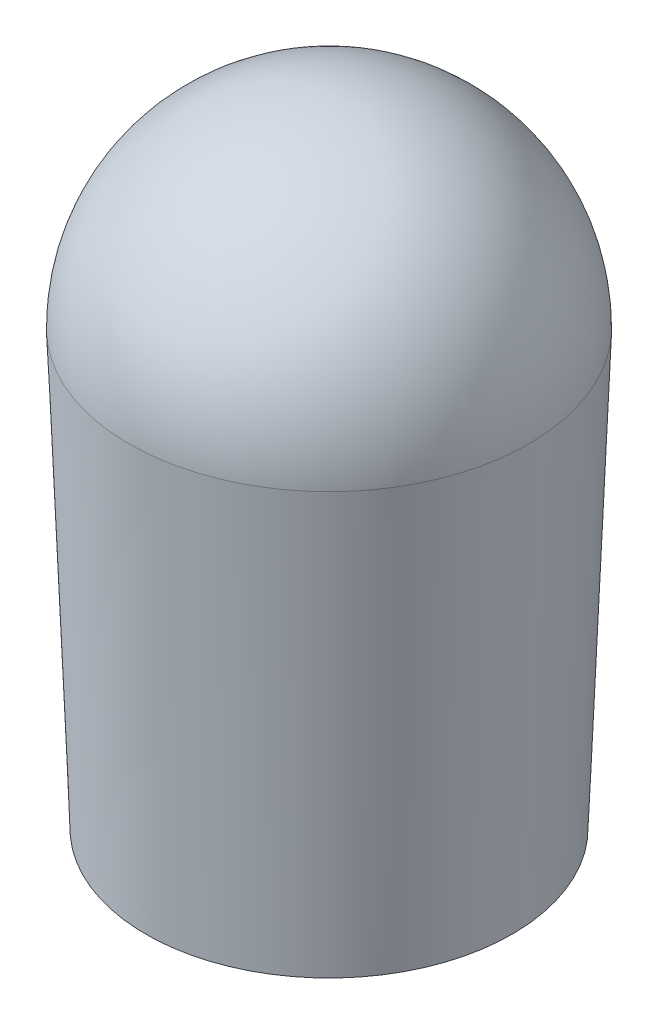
ISO-10303-21;
HEADER;
FILE_DESCRIPTION(('STEP AP214'),'2;1');
FILE_NAME('part.step','',(''),(''),'','','');
FILE_SCHEMA(('AUTOMOTIVE_DESIGN { 1 0 10303 214 1 1 1 1 }'));
ENDSEC;
DATA;
#1=APPLICATION_CONTEXT('core data for automotive mechanical design processes');
#2=APPLICATION_PROTOCOL_DEFINITION('international standard','automotive_design',2000,#1);
#3=PRODUCT_CONTEXT('',#1,'mechanical');
#4=PRODUCT('Part','Part','',(#3));
#5=PRODUCT_RELATED_PRODUCT_CATEGORY('part','',(#4));
#6=PRODUCT_DEFINITION_FORMATION('','',#4);
#7=PRODUCT_DEFINITION_CONTEXT('part definition',#1,'design');
#8=PRODUCT_DEFINITION('design','',#6,#7);
#9=PRODUCT_DEFINITION_SHAPE('','',#8);
#10=(LENGTH_UNIT() NAMED_UNIT(*) SI_UNIT(.MILLI.,.METRE.));
#11=(NAMED_UNIT(*) PLANE_ANGLE_UNIT() SI_UNIT($,.RADIAN.));
#12=(NAMED_UNIT(*) SI_UNIT($,.STERADIAN.) SOLID_ANGLE_UNIT());
#13=UNCERTAINTY_MEASURE_WITH_UNIT(LENGTH_MEASURE(1.E-05),#10,'distance_accuracy_value','');
#14=(GEOMETRIC_REPRESENTATION_CONTEXT(3) GLOBAL_UNCERTAINTY_ASSIGNED_CONTEXT((#13)) GLOBAL_UNIT_ASSIGNED_CONTEXT((#10,
#11,#12)) REPRESENTATION_CONTEXT('',''));
#15=CARTESIAN_POINT('',(0.,0.,0.));
#16=DIRECTION('',(0.,0.,1.));
#17=DIRECTION('',(1.,0.,0.));
#18=AXIS2_PLACEMENT_3D('',#15,#16,#17);
#19=CARTESIAN_POINT('',(0.,13.,0.));
#20=DIRECTION('',(0.,1.,0.));
#21=DIRECTION('',(0.,0.,1.));
#22=AXIS2_PLACEMENT_3D('',#19,#20,#21);
#23=CONICAL_SURFACE('',#22,6.,0.0384425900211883);
#24=CARTESIAN_POINT('',(0.,0.,0.));
#25=DIRECTION('',(0.,-1.,0.));
#26=DIRECTION('',(0.,0.,-1.));
#27=AXIS2_PLACEMENT_3D('',#24,#25,#26);
#28=CIRCLE('',#27,5.5);
#29=CARTESIAN_POINT('',(0.,0.,-5.5));
#30=VERTEX_POINT('',#29);
#31=EDGE_CURVE('E10',#30,#30,#28,.T.);
#32=ORIENTED_EDGE('',*,*,#31,.F.);
#33=EDGE_LOOP('',(#32));
#34=FACE_BOUND('',#33,.T.);
#35=CARTESIAN_POINT('',(0.,13.,0.));
#36=DIRECTION('',(0.,-1.,0.));
#37=DIRECTION('',(0.,0.,-1.));
#38=AXIS2_PLACEMENT_3D('',#35,#36,#37);
#39=CIRCLE('',#38,6.);
#40=CARTESIAN_POINT('',(0.,13.,-6.));
#41=VERTEX_POINT('',#40);
#42=EDGE_CURVE('E43',#41,#41,#39,.T.);
#43=ORIENTED_EDGE('',*,*,#42,.T.);
#44=EDGE_LOOP('',(#43));
#45=FACE_BOUND('',#44,.T.);
#46=ADVANCED_FACE('F29',(#34,#45),#23,.T.);
#47=CARTESIAN_POINT('',(-5.5,0.,0.));
#48=DIRECTION('',(0.,1.,0.));
#49=DIRECTION('',(0.,0.,1.));
#50=AXIS2_PLACEMENT_3D('',#47,#48,#49);
#51=PLANE('',#50);
#52=CARTESIAN_POINT('',(0.,0.,0.));
#53=DIRECTION('',(0.,-1.,0.));
#54=DIRECTION('',(0.,0.,-1.));
#55=AXIS2_PLACEMENT_3D('',#52,#53,#54);
#56=CIRCLE('',#55,4.);
#57=CARTESIAN_POINT('',(0.,0.,-4.));
#58=VERTEX_POINT('',#57);
#59=EDGE_CURVE('E35',#58,#58,#56,.T.);
#60=ORIENTED_EDGE('',*,*,#59,.F.);
#61=EDGE_LOOP('',(#60));
#62=FACE_BOUND('',#61,.T.);
#63=ORIENTED_EDGE('',*,*,#31,.T.);
#64=EDGE_LOOP('',(#63));
#65=FACE_BOUND('',#64,.T.);
#66=ADVANCED_FACE('F61',(#62,#65),#51,.F.);
#67=CARTESIAN_POINT('',(0.,-23.1816593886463,0.));
#68=DIRECTION('',(0.,-1.,0.));
#69=DIRECTION('',(0.,0.,-1.));
#70=AXIS2_PLACEMENT_3D('',#67,#68,#69);
#71=CYLINDRICAL_SURFACE('',#70,4.);
#72=CARTESIAN_POINT('',(0.,15.,0.));
#73=DIRECTION('',(0.,-1.,0.));
#74=DIRECTION('',(0.,0.,-1.));
#75=AXIS2_PLACEMENT_3D('',#72,#73,#74);
#76=CIRCLE('',#75,4.);
#77=CARTESIAN_POINT('',(0.,15.,-4.));
#78=VERTEX_POINT('',#77);
#79=EDGE_CURVE('E39',#78,#78,#76,.T.);
#80=ORIENTED_EDGE('',*,*,#79,.F.);
#81=EDGE_LOOP('',(#80));
#82=FACE_BOUND('',#81,.T.);
#83=ORIENTED_EDGE('',*,*,#59,.T.);
#84=EDGE_LOOP('',(#83));
#85=FACE_BOUND('',#84,.T.);
#86=ADVANCED_FACE('F57',(#82,#85),#71,.F.);
#87=CARTESIAN_POINT('',(-4.,15.,0.));
#88=DIRECTION('',(0.,1.,0.));
#89=DIRECTION('',(0.,0.,1.));
#90=AXIS2_PLACEMENT_3D('',#87,#88,#89);
#91=PLANE('',#90);
#92=ORIENTED_EDGE('',*,*,#79,.T.);
#93=EDGE_LOOP('',(#92));
#94=FACE_BOUND('',#93,.T.);
#95=ADVANCED_FACE('F52',(#94),#91,.F.);
#96=CARTESIAN_POINT('',(0.,13.,0.));
#97=DIRECTION('',(0.,-1.,0.));
#98=DIRECTION('',(-1.,0.,0.));
#99=AXIS2_PLACEMENT_3D('',#96,#97,#98);
#100=SPHERICAL_SURFACE('',#99,6.);
#101=ORIENTED_EDGE('',*,*,#42,.F.);
#102=EDGE_LOOP('',(#101));
#103=FACE_BOUND('',#102,.T.);
#104=ADVANCED_FACE('F50',(#103),#100,.T.);
#105=CLOSED_SHELL('',(#46,#66,#86,#95,#104));
#106=MANIFOLD_SOLID_BREP('B2',#105);
#107=ADVANCED_BREP_SHAPE_REPRESENTATION('',(#18,#106),#14);
#108=SHAPE_DEFINITION_REPRESENTATION(#9,#107);
ENDSEC;
END-ISO-10303-21;
